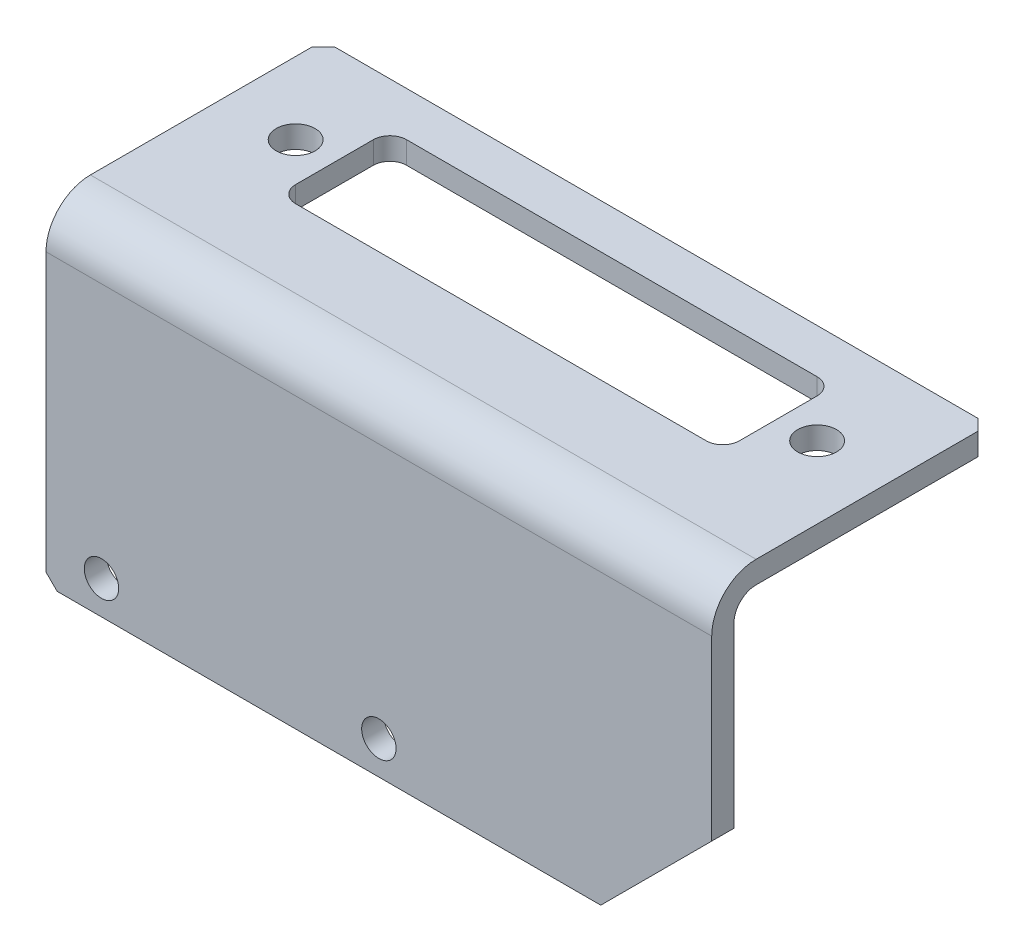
ISO-10303-21;
HEADER;
FILE_DESCRIPTION(('STEP AP214'),'2;1');
FILE_NAME('part.step','',(''),(''),'','','');
FILE_SCHEMA(('AUTOMOTIVE_DESIGN { 1 0 10303 214 1 1 1 1 }'));
ENDSEC;
DATA;
#1=APPLICATION_CONTEXT('core data for automotive mechanical design processes');
#2=APPLICATION_PROTOCOL_DEFINITION('international standard','automotive_design',2000,#1);
#3=PRODUCT_CONTEXT('',#1,'mechanical');
#4=PRODUCT('Part','Part','',(#3));
#5=PRODUCT_RELATED_PRODUCT_CATEGORY('part','',(#4));
#6=PRODUCT_DEFINITION_FORMATION('','',#4);
#7=PRODUCT_DEFINITION_CONTEXT('part definition',#1,'design');
#8=PRODUCT_DEFINITION('design','',#6,#7);
#9=PRODUCT_DEFINITION_SHAPE('','',#8);
#10=(LENGTH_UNIT() NAMED_UNIT(*) SI_UNIT(.MILLI.,.METRE.));
#11=(NAMED_UNIT(*) PLANE_ANGLE_UNIT() SI_UNIT($,.RADIAN.));
#12=(NAMED_UNIT(*) SI_UNIT($,.STERADIAN.) SOLID_ANGLE_UNIT());
#13=UNCERTAINTY_MEASURE_WITH_UNIT(LENGTH_MEASURE(1.E-05),#10,'distance_accuracy_value','');
#14=(GEOMETRIC_REPRESENTATION_CONTEXT(3) GLOBAL_UNCERTAINTY_ASSIGNED_CONTEXT((#13)) GLOBAL_UNIT_ASSIGNED_CONTEXT((#10,
#11,#12)) REPRESENTATION_CONTEXT('',''));
#15=CARTESIAN_POINT('',(0.,0.,0.));
#16=DIRECTION('',(0.,0.,1.));
#17=DIRECTION('',(1.,0.,0.));
#18=AXIS2_PLACEMENT_3D('',#15,#16,#17);
#19=CARTESIAN_POINT('',(53.5,-2.,-16.));
#20=DIRECTION('',(0.,-1.,0.));
#21=DIRECTION('',(0.,0.,-1.));
#22=AXIS2_PLACEMENT_3D('',#19,#20,#21);
#23=CYLINDRICAL_SURFACE('',#22,1.75);
#24=CARTESIAN_POINT('',(53.5,-2.,-16.));
#25=DIRECTION('',(0.,-1.,0.));
#26=DIRECTION('',(0.,0.,-1.));
#27=AXIS2_PLACEMENT_3D('',#24,#25,#26);
#28=CIRCLE('',#27,1.75);
#29=CARTESIAN_POINT('',(53.5,-2.,-17.75));
#30=VERTEX_POINT('',#29);
#31=EDGE_CURVE('E252',#30,#30,#28,.F.);
#32=ORIENTED_EDGE('',*,*,#31,.F.);
#33=EDGE_LOOP('',(#32));
#34=FACE_BOUND('',#33,.T.);
#35=CARTESIAN_POINT('',(53.5,0.,-16.));
#36=DIRECTION('',(0.,-1.,0.));
#37=DIRECTION('',(0.,0.,-1.));
#38=AXIS2_PLACEMENT_3D('',#35,#36,#37);
#39=CIRCLE('',#38,1.75);
#40=CARTESIAN_POINT('',(53.5,0.,-17.75));
#41=VERTEX_POINT('',#40);
#42=EDGE_CURVE('E19',#41,#41,#39,.T.);
#43=ORIENTED_EDGE('',*,*,#42,.F.);
#44=EDGE_LOOP('',(#43));
#45=FACE_BOUND('',#44,.T.);
#46=ADVANCED_FACE('F16',(#34,#45),#23,.F.);
#47=CARTESIAN_POINT('',(6.5,-2.,-16.));
#48=DIRECTION('',(0.,-1.,0.));
#49=DIRECTION('',(0.,0.,-1.));
#50=AXIS2_PLACEMENT_3D('',#47,#48,#49);
#51=CYLINDRICAL_SURFACE('',#50,1.75);
#52=CARTESIAN_POINT('',(6.5,-2.,-16.));
#53=DIRECTION('',(0.,-1.,0.));
#54=DIRECTION('',(0.,0.,-1.));
#55=AXIS2_PLACEMENT_3D('',#52,#53,#54);
#56=CIRCLE('',#55,1.75);
#57=CARTESIAN_POINT('',(6.5,-2.,-17.75));
#58=VERTEX_POINT('',#57);
#59=EDGE_CURVE('E249',#58,#58,#56,.F.);
#60=ORIENTED_EDGE('',*,*,#59,.F.);
#61=EDGE_LOOP('',(#60));
#62=FACE_BOUND('',#61,.T.);
#63=CARTESIAN_POINT('',(6.5,0.,-16.));
#64=DIRECTION('',(0.,-1.,0.));
#65=DIRECTION('',(0.,0.,-1.));
#66=AXIS2_PLACEMENT_3D('',#63,#64,#65);
#67=CIRCLE('',#66,1.75);
#68=CARTESIAN_POINT('',(6.5,0.,-17.75));
#69=VERTEX_POINT('',#68);
#70=EDGE_CURVE('E160',#69,#69,#67,.T.);
#71=ORIENTED_EDGE('',*,*,#70,.F.);
#72=EDGE_LOOP('',(#71));
#73=FACE_BOUND('',#72,.T.);
#74=ADVANCED_FACE('F428',(#62,#73),#51,.F.);
#75=CARTESIAN_POINT('',(11.5,-2.,-21.));
#76=DIRECTION('',(0.,0.,-1.));
#77=DIRECTION('',(-1.,0.,0.));
#78=AXIS2_PLACEMENT_3D('',#75,#76,#77);
#79=PLANE('',#78);
#80=DIRECTION('',(1.,0.,0.));
#81=VECTOR('',#80,1.);
#82=CARTESIAN_POINT('',(0.,-2.,-21.));
#83=LINE('',#82,#81);
#84=CARTESIAN_POINT('',(48.5,-2.,-21.));
#85=VERTEX_POINT('',#84);
#86=CARTESIAN_POINT('',(11.5,-2.,-21.));
#87=VERTEX_POINT('',#86);
#88=EDGE_CURVE('E248',#85,#87,#83,.F.);
#89=ORIENTED_EDGE('',*,*,#88,.F.);
#90=DIRECTION('',(0.,-1.,0.));
#91=VECTOR('',#90,1.);
#92=CARTESIAN_POINT('',(48.5,-2.,-21.));
#93=LINE('',#92,#91);
#94=CARTESIAN_POINT('',(48.5,0.,-21.));
#95=VERTEX_POINT('',#94);
#96=EDGE_CURVE('E187',#85,#95,#93,.F.);
#97=ORIENTED_EDGE('',*,*,#96,.T.);
#98=DIRECTION('',(1.,0.,0.));
#99=VECTOR('',#98,1.);
#100=CARTESIAN_POINT('',(0.,0.,-21.));
#101=LINE('',#100,#99);
#102=CARTESIAN_POINT('',(11.5,0.,-21.));
#103=VERTEX_POINT('',#102);
#104=EDGE_CURVE('E258',#103,#95,#101,.T.);
#105=ORIENTED_EDGE('',*,*,#104,.F.);
#106=DIRECTION('',(0.,-1.,0.));
#107=VECTOR('',#106,1.);
#108=CARTESIAN_POINT('',(11.5,-2.,-21.));
#109=LINE('',#108,#107);
#110=EDGE_CURVE('E195',#103,#87,#109,.T.);
#111=ORIENTED_EDGE('',*,*,#110,.T.);
#112=EDGE_LOOP('',(#89,#97,#105,#111));
#113=FACE_BOUND('',#112,.T.);
#114=ADVANCED_FACE('F417',(#113),#79,.F.);
#115=CARTESIAN_POINT('',(11.5,-2.,-19.5));
#116=DIRECTION('',(0.,-1.,0.));
#117=DIRECTION('',(0.,0.,-1.));
#118=AXIS2_PLACEMENT_3D('',#115,#116,#117);
#119=CYLINDRICAL_SURFACE('',#118,1.5);
#120=CARTESIAN_POINT('',(11.5,-2.,-19.5));
#121=DIRECTION('',(0.,-1.,0.));
#122=DIRECTION('',(0.,0.,-1.));
#123=AXIS2_PLACEMENT_3D('',#120,#121,#122);
#124=CIRCLE('',#123,1.5);
#125=CARTESIAN_POINT('',(10.,-2.,-19.5));
#126=VERTEX_POINT('',#125);
#127=EDGE_CURVE('E245',#87,#126,#124,.F.);
#128=ORIENTED_EDGE('',*,*,#127,.F.);
#129=ORIENTED_EDGE('',*,*,#110,.F.);
#130=CARTESIAN_POINT('',(11.5,0.,-19.5));
#131=DIRECTION('',(0.,-1.,0.));
#132=DIRECTION('',(0.,0.,-1.));
#133=AXIS2_PLACEMENT_3D('',#130,#131,#132);
#134=CIRCLE('',#133,1.5);
#135=CARTESIAN_POINT('',(10.,0.,-19.5));
#136=VERTEX_POINT('',#135);
#137=EDGE_CURVE('E259',#136,#103,#134,.T.);
#138=ORIENTED_EDGE('',*,*,#137,.F.);
#139=DIRECTION('',(0.,1.,0.));
#140=VECTOR('',#139,1.);
#141=CARTESIAN_POINT('',(10.,-2.,-19.5));
#142=LINE('',#141,#140);
#143=EDGE_CURVE('E193',#136,#126,#142,.F.);
#144=ORIENTED_EDGE('',*,*,#143,.T.);
#145=EDGE_LOOP('',(#128,#129,#138,#144));
#146=FACE_BOUND('',#145,.T.);
#147=ADVANCED_FACE('F419',(#146),#119,.F.);
#148=CARTESIAN_POINT('',(10.,-2.,-12.5));
#149=DIRECTION('',(-1.,0.,0.));
#150=DIRECTION('',(0.,0.,1.));
#151=AXIS2_PLACEMENT_3D('',#148,#149,#150);
#152=PLANE('',#151);
#153=DIRECTION('',(0.,0.,-1.));
#154=VECTOR('',#153,1.);
#155=CARTESIAN_POINT('',(10.,-2.,-4.));
#156=LINE('',#155,#154);
#157=CARTESIAN_POINT('',(10.,-2.,-12.5));
#158=VERTEX_POINT('',#157);
#159=EDGE_CURVE('E244',#126,#158,#156,.F.);
#160=ORIENTED_EDGE('',*,*,#159,.F.);
#161=ORIENTED_EDGE('',*,*,#143,.F.);
#162=DIRECTION('',(0.,0.,1.));
#163=VECTOR('',#162,1.);
#164=CARTESIAN_POINT('',(10.,0.,-25.));
#165=LINE('',#164,#163);
#166=CARTESIAN_POINT('',(10.,0.,-12.5));
#167=VERTEX_POINT('',#166);
#168=EDGE_CURVE('E261',#167,#136,#165,.F.);
#169=ORIENTED_EDGE('',*,*,#168,.F.);
#170=DIRECTION('',(0.,-1.,0.));
#171=VECTOR('',#170,1.);
#172=CARTESIAN_POINT('',(10.,-2.,-12.5));
#173=LINE('',#172,#171);
#174=EDGE_CURVE('E191',#167,#158,#173,.T.);
#175=ORIENTED_EDGE('',*,*,#174,.T.);
#176=EDGE_LOOP('',(#160,#161,#169,#175));
#177=FACE_BOUND('',#176,.T.);
#178=ADVANCED_FACE('F405',(#177),#152,.F.);
#179=CARTESIAN_POINT('',(11.5,-2.,-12.5));
#180=DIRECTION('',(0.,-1.,0.));
#181=DIRECTION('',(0.,0.,-1.));
#182=AXIS2_PLACEMENT_3D('',#179,#180,#181);
#183=CYLINDRICAL_SURFACE('',#182,1.5);
#184=CARTESIAN_POINT('',(11.5,-2.,-12.5));
#185=DIRECTION('',(0.,-1.,0.));
#186=DIRECTION('',(0.,0.,-1.));
#187=AXIS2_PLACEMENT_3D('',#184,#185,#186);
#188=CIRCLE('',#187,1.5);
#189=CARTESIAN_POINT('',(11.5,-2.,-11.));
#190=VERTEX_POINT('',#189);
#191=EDGE_CURVE('E241',#158,#190,#188,.F.);
#192=ORIENTED_EDGE('',*,*,#191,.F.);
#193=ORIENTED_EDGE('',*,*,#174,.F.);
#194=CARTESIAN_POINT('',(11.5,0.,-12.5));
#195=DIRECTION('',(0.,-1.,0.));
#196=DIRECTION('',(0.,0.,-1.));
#197=AXIS2_PLACEMENT_3D('',#194,#195,#196);
#198=CIRCLE('',#197,1.5);
#199=CARTESIAN_POINT('',(11.5,0.,-11.));
#200=VERTEX_POINT('',#199);
#201=EDGE_CURVE('E152',#200,#167,#198,.T.);
#202=ORIENTED_EDGE('',*,*,#201,.F.);
#203=DIRECTION('',(0.,1.,0.));
#204=VECTOR('',#203,1.);
#205=CARTESIAN_POINT('',(11.5,-2.,-11.));
#206=LINE('',#205,#204);
#207=EDGE_CURVE('E144',#200,#190,#206,.F.);
#208=ORIENTED_EDGE('',*,*,#207,.T.);
#209=EDGE_LOOP('',(#192,#193,#202,#208));
#210=FACE_BOUND('',#209,.T.);
#211=ADVANCED_FACE('F407',(#210),#183,.F.);
#212=CARTESIAN_POINT('',(48.5,-2.,-11.));
#213=DIRECTION('',(0.,0.,1.));
#214=DIRECTION('',(1.,0.,0.));
#215=AXIS2_PLACEMENT_3D('',#212,#213,#214);
#216=PLANE('',#215);
#217=DIRECTION('',(1.,0.,0.));
#218=VECTOR('',#217,1.);
#219=CARTESIAN_POINT('',(0.,-2.,-11.));
#220=LINE('',#219,#218);
#221=CARTESIAN_POINT('',(48.5,-2.,-11.));
#222=VERTEX_POINT('',#221);
#223=EDGE_CURVE('E240',#190,#222,#220,.T.);
#224=ORIENTED_EDGE('',*,*,#223,.F.);
#225=ORIENTED_EDGE('',*,*,#207,.F.);
#226=DIRECTION('',(1.,0.,0.));
#227=VECTOR('',#226,1.);
#228=CARTESIAN_POINT('',(0.,0.,-11.));
#229=LINE('',#228,#227);
#230=CARTESIAN_POINT('',(48.5,0.,-11.));
#231=VERTEX_POINT('',#230);
#232=EDGE_CURVE('E147',#231,#200,#229,.F.);
#233=ORIENTED_EDGE('',*,*,#232,.F.);
#234=DIRECTION('',(0.,-1.,0.));
#235=VECTOR('',#234,1.);
#236=CARTESIAN_POINT('',(48.5,-2.,-11.));
#237=LINE('',#236,#235);
#238=EDGE_CURVE('E133',#231,#222,#237,.T.);
#239=ORIENTED_EDGE('',*,*,#238,.T.);
#240=EDGE_LOOP('',(#224,#225,#233,#239));
#241=FACE_BOUND('',#240,.T.);
#242=ADVANCED_FACE('F148',(#241),#216,.F.);
#243=CARTESIAN_POINT('',(48.5,-2.,-12.5));
#244=DIRECTION('',(0.,-1.,0.));
#245=DIRECTION('',(0.,0.,-1.));
#246=AXIS2_PLACEMENT_3D('',#243,#244,#245);
#247=CYLINDRICAL_SURFACE('',#246,1.5);
#248=CARTESIAN_POINT('',(48.5,-2.,-12.5));
#249=DIRECTION('',(0.,-1.,0.));
#250=DIRECTION('',(0.,0.,-1.));
#251=AXIS2_PLACEMENT_3D('',#248,#249,#250);
#252=CIRCLE('',#251,1.5);
#253=CARTESIAN_POINT('',(50.,-2.,-12.5));
#254=VERTEX_POINT('',#253);
#255=EDGE_CURVE('E140',#222,#254,#252,.F.);
#256=ORIENTED_EDGE('',*,*,#255,.F.);
#257=ORIENTED_EDGE('',*,*,#238,.F.);
#258=CARTESIAN_POINT('',(48.5,0.,-12.5));
#259=DIRECTION('',(0.,-1.,0.));
#260=DIRECTION('',(0.,0.,-1.));
#261=AXIS2_PLACEMENT_3D('',#258,#259,#260);
#262=CIRCLE('',#261,1.5);
#263=CARTESIAN_POINT('',(50.,0.,-12.5));
#264=VERTEX_POINT('',#263);
#265=EDGE_CURVE('E137',#264,#231,#262,.T.);
#266=ORIENTED_EDGE('',*,*,#265,.F.);
#267=DIRECTION('',(0.,1.,0.));
#268=VECTOR('',#267,1.);
#269=CARTESIAN_POINT('',(50.,-2.,-12.5));
#270=LINE('',#269,#268);
#271=EDGE_CURVE('E128',#264,#254,#270,.F.);
#272=ORIENTED_EDGE('',*,*,#271,.T.);
#273=EDGE_LOOP('',(#256,#257,#266,#272));
#274=FACE_BOUND('',#273,.T.);
#275=ADVANCED_FACE('F135',(#274),#247,.F.);
#276=CARTESIAN_POINT('',(50.,-2.,-19.5));
#277=DIRECTION('',(1.,0.,0.));
#278=DIRECTION('',(0.,0.,-1.));
#279=AXIS2_PLACEMENT_3D('',#276,#277,#278);
#280=PLANE('',#279);
#281=DIRECTION('',(0.,0.,-1.));
#282=VECTOR('',#281,1.);
#283=CARTESIAN_POINT('',(50.,-2.,-4.));
#284=LINE('',#283,#282);
#285=CARTESIAN_POINT('',(50.,-2.,-19.5));
#286=VERTEX_POINT('',#285);
#287=EDGE_CURVE('E238',#254,#286,#284,.T.);
#288=ORIENTED_EDGE('',*,*,#287,.F.);
#289=ORIENTED_EDGE('',*,*,#271,.F.);
#290=DIRECTION('',(0.,0.,1.));
#291=VECTOR('',#290,1.);
#292=CARTESIAN_POINT('',(50.,0.,-25.));
#293=LINE('',#292,#291);
#294=CARTESIAN_POINT('',(50.,0.,-19.5));
#295=VERTEX_POINT('',#294);
#296=EDGE_CURVE('E158',#295,#264,#293,.T.);
#297=ORIENTED_EDGE('',*,*,#296,.F.);
#298=DIRECTION('',(0.,-1.,0.));
#299=VECTOR('',#298,1.);
#300=CARTESIAN_POINT('',(50.,-2.,-19.5));
#301=LINE('',#300,#299);
#302=EDGE_CURVE('E185',#295,#286,#301,.T.);
#303=ORIENTED_EDGE('',*,*,#302,.T.);
#304=EDGE_LOOP('',(#288,#289,#297,#303));
#305=FACE_BOUND('',#304,.T.);
#306=ADVANCED_FACE('F409',(#305),#280,.F.);
#307=CARTESIAN_POINT('',(48.5,-2.,-19.5));
#308=DIRECTION('',(0.,-1.,0.));
#309=DIRECTION('',(0.,0.,-1.));
#310=AXIS2_PLACEMENT_3D('',#307,#308,#309);
#311=CYLINDRICAL_SURFACE('',#310,1.5);
#312=CARTESIAN_POINT('',(48.5,-2.,-19.5));
#313=DIRECTION('',(0.,-1.,0.));
#314=DIRECTION('',(0.,0.,-1.));
#315=AXIS2_PLACEMENT_3D('',#312,#313,#314);
#316=CIRCLE('',#315,1.5);
#317=EDGE_CURVE('E234',#286,#85,#316,.F.);
#318=ORIENTED_EDGE('',*,*,#317,.F.);
#319=ORIENTED_EDGE('',*,*,#302,.F.);
#320=CARTESIAN_POINT('',(48.5,0.,-19.5));
#321=DIRECTION('',(0.,-1.,0.));
#322=DIRECTION('',(0.,0.,-1.));
#323=AXIS2_PLACEMENT_3D('',#320,#321,#322);
#324=CIRCLE('',#323,1.5);
#325=EDGE_CURVE('E256',#95,#295,#324,.T.);
#326=ORIENTED_EDGE('',*,*,#325,.F.);
#327=ORIENTED_EDGE('',*,*,#96,.F.);
#328=EDGE_LOOP('',(#318,#319,#326,#327));
#329=FACE_BOUND('',#328,.T.);
#330=ADVANCED_FACE('F414',(#329),#311,.F.);
#331=CARTESIAN_POINT('',(0.,-2.,-25.));
#332=DIRECTION('',(0.,0.,-1.));
#333=DIRECTION('',(-1.,0.,0.));
#334=AXIS2_PLACEMENT_3D('',#331,#332,#333);
#335=PLANE('',#334);
#336=DIRECTION('',(1.,0.,0.));
#337=VECTOR('',#336,1.);
#338=CARTESIAN_POINT('',(0.,-2.,-25.));
#339=LINE('',#338,#337);
#340=CARTESIAN_POINT('',(1.,-2.,-25.));
#341=VERTEX_POINT('',#340);
#342=CARTESIAN_POINT('',(59.,-2.,-25.));
#343=VERTEX_POINT('',#342);
#344=EDGE_CURVE('E291',#341,#343,#339,.T.);
#345=ORIENTED_EDGE('',*,*,#344,.F.);
#346=DIRECTION('',(0.,1.,0.));
#347=VECTOR('',#346,1.);
#348=CARTESIAN_POINT('',(1.,-2.,-25.));
#349=LINE('',#348,#347);
#350=CARTESIAN_POINT('',(1.,0.,-25.));
#351=VERTEX_POINT('',#350);
#352=EDGE_CURVE('E271',#351,#341,#349,.F.);
#353=ORIENTED_EDGE('',*,*,#352,.F.);
#354=DIRECTION('',(1.,0.,0.));
#355=VECTOR('',#354,1.);
#356=CARTESIAN_POINT('',(0.,0.,-25.));
#357=LINE('',#356,#355);
#358=CARTESIAN_POINT('',(59.,0.,-25.));
#359=VERTEX_POINT('',#358);
#360=EDGE_CURVE('E167',#359,#351,#357,.F.);
#361=ORIENTED_EDGE('',*,*,#360,.F.);
#362=DIRECTION('',(0.,1.,0.));
#363=VECTOR('',#362,1.);
#364=CARTESIAN_POINT('',(59.,-2.,-25.));
#365=LINE('',#364,#363);
#366=EDGE_CURVE('E177',#359,#343,#365,.F.);
#367=ORIENTED_EDGE('',*,*,#366,.T.);
#368=EDGE_LOOP('',(#345,#353,#361,#367));
#369=FACE_BOUND('',#368,.T.);
#370=ADVANCED_FACE('F484',(#369),#335,.T.);
#371=CARTESIAN_POINT('',(60.,-2.,-24.));
#372=DIRECTION('',(-0.707106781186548,0.,0.707106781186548));
#373=DIRECTION('',(0.707106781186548,0.,0.707106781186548));
#374=AXIS2_PLACEMENT_3D('',#371,#372,#373);
#375=PLANE('',#374);
#376=ORIENTED_EDGE('',*,*,#366,.F.);
#377=DIRECTION('',(-0.707106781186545,0.,-0.70710678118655));
#378=VECTOR('',#377,1.);
#379=CARTESIAN_POINT('',(60.,0.,-24.));
#380=LINE('',#379,#378);
#381=CARTESIAN_POINT('',(60.,0.,-24.));
#382=VERTEX_POINT('',#381);
#383=EDGE_CURVE('E170',#382,#359,#380,.T.);
#384=ORIENTED_EDGE('',*,*,#383,.F.);
#385=DIRECTION('',(0.,1.,0.));
#386=VECTOR('',#385,1.);
#387=CARTESIAN_POINT('',(60.,0.,-24.));
#388=LINE('',#387,#386);
#389=CARTESIAN_POINT('',(60.,-2.,-24.));
#390=VERTEX_POINT('',#389);
#391=EDGE_CURVE('E283',#390,#382,#388,.T.);
#392=ORIENTED_EDGE('',*,*,#391,.F.);
#393=DIRECTION('',(0.707106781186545,0.,0.70710678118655));
#394=VECTOR('',#393,1.);
#395=CARTESIAN_POINT('',(59.,-2.,-25.));
#396=LINE('',#395,#394);
#397=EDGE_CURVE('E255',#343,#390,#396,.T.);
#398=ORIENTED_EDGE('',*,*,#397,.F.);
#399=EDGE_LOOP('',(#376,#384,#392,#398));
#400=FACE_BOUND('',#399,.T.);
#401=ADVANCED_FACE('F481',(#400),#375,.F.);
#402=CARTESIAN_POINT('',(0.,0.,-25.));
#403=DIRECTION('',(0.,1.,0.));
#404=DIRECTION('',(0.,0.,1.));
#405=AXIS2_PLACEMENT_3D('',#402,#403,#404);
#406=PLANE('',#405);
#407=ORIENTED_EDGE('',*,*,#104,.T.);
#408=ORIENTED_EDGE('',*,*,#325,.T.);
#409=ORIENTED_EDGE('',*,*,#296,.T.);
#410=ORIENTED_EDGE('',*,*,#265,.T.);
#411=ORIENTED_EDGE('',*,*,#232,.T.);
#412=ORIENTED_EDGE('',*,*,#201,.T.);
#413=ORIENTED_EDGE('',*,*,#168,.T.);
#414=ORIENTED_EDGE('',*,*,#137,.T.);
#415=EDGE_LOOP('',(#407,#408,#409,#410,#411,#412,#413,#414));
#416=FACE_BOUND('',#415,.T.);
#417=ORIENTED_EDGE('',*,*,#70,.T.);
#418=EDGE_LOOP('',(#417));
#419=FACE_BOUND('',#418,.T.);
#420=ORIENTED_EDGE('',*,*,#42,.T.);
#421=EDGE_LOOP('',(#420));
#422=FACE_BOUND('',#421,.T.);
#423=DIRECTION('',(-0.707106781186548,0.,0.707106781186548));
#424=VECTOR('',#423,1.);
#425=CARTESIAN_POINT('',(0.,0.,-24.));
#426=LINE('',#425,#424);
#427=CARTESIAN_POINT('',(0.,0.,-24.));
#428=VERTEX_POINT('',#427);
#429=EDGE_CURVE('E237',#428,#351,#426,.F.);
#430=ORIENTED_EDGE('',*,*,#429,.F.);
#431=DIRECTION('',(0.,0.,-1.));
#432=VECTOR('',#431,1.);
#433=CARTESIAN_POINT('',(0.,0.,0.));
#434=LINE('',#433,#432);
#435=CARTESIAN_POINT('',(0.,0.,-4.));
#436=VERTEX_POINT('',#435);
#437=EDGE_CURVE('E224',#428,#436,#434,.F.);
#438=ORIENTED_EDGE('',*,*,#437,.T.);
#439=DIRECTION('',(1.,0.,0.));
#440=VECTOR('',#439,1.);
#441=CARTESIAN_POINT('',(0.,0.,-4.));
#442=LINE('',#441,#440);
#443=CARTESIAN_POINT('',(60.,0.,-4.));
#444=VERTEX_POINT('',#443);
#445=EDGE_CURVE('E257',#444,#436,#442,.F.);
#446=ORIENTED_EDGE('',*,*,#445,.F.);
#447=DIRECTION('',(0.,0.,-1.));
#448=VECTOR('',#447,1.);
#449=CARTESIAN_POINT('',(60.,0.,0.));
#450=LINE('',#449,#448);
#451=EDGE_CURVE('E286',#382,#444,#450,.F.);
#452=ORIENTED_EDGE('',*,*,#451,.F.);
#453=ORIENTED_EDGE('',*,*,#383,.T.);
#454=ORIENTED_EDGE('',*,*,#360,.T.);
#455=EDGE_LOOP('',(#430,#438,#446,#452,#453,#454));
#456=FACE_BOUND('',#455,.T.);
#457=ADVANCED_FACE('F155',(#416,#419,#422,#456),#406,.T.);
#458=CARTESIAN_POINT('',(0.,-4.,-4.));
#459=DIRECTION('',(1.,0.,0.));
#460=DIRECTION('',(0.,0.,-1.));
#461=AXIS2_PLACEMENT_3D('',#458,#459,#460);
#462=CYLINDRICAL_SURFACE('',#461,4.);
#463=ORIENTED_EDGE('',*,*,#445,.T.);
#464=CARTESIAN_POINT('',(0.,-4.,-4.));
#465=DIRECTION('',(1.,0.,0.));
#466=DIRECTION('',(0.,0.,-1.));
#467=AXIS2_PLACEMENT_3D('',#464,#465,#466);
#468=CIRCLE('',#467,4.);
#469=CARTESIAN_POINT('',(0.,-4.,0.));
#470=VERTEX_POINT('',#469);
#471=EDGE_CURVE('E221',#436,#470,#468,.T.);
#472=ORIENTED_EDGE('',*,*,#471,.T.);
#473=DIRECTION('',(1.,0.,0.));
#474=VECTOR('',#473,1.);
#475=CARTESIAN_POINT('',(0.,-4.,0.));
#476=LINE('',#475,#474);
#477=CARTESIAN_POINT('',(60.,-4.,0.));
#478=VERTEX_POINT('',#477);
#479=EDGE_CURVE('E317',#478,#470,#476,.F.);
#480=ORIENTED_EDGE('',*,*,#479,.F.);
#481=CARTESIAN_POINT('',(60.,-4.,-4.));
#482=DIRECTION('',(1.,0.,0.));
#483=DIRECTION('',(0.,0.,-1.));
#484=AXIS2_PLACEMENT_3D('',#481,#482,#483);
#485=CIRCLE('',#484,4.);
#486=EDGE_CURVE('E230',#444,#478,#485,.T.);
#487=ORIENTED_EDGE('',*,*,#486,.F.);
#488=EDGE_LOOP('',(#463,#472,#480,#487));
#489=FACE_BOUND('',#488,.T.);
#490=ADVANCED_FACE('F338',(#489),#462,.T.);
#491=CARTESIAN_POINT('',(0.,-29.,0.));
#492=DIRECTION('',(-0.707106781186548,-0.707106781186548,0.));
#493=DIRECTION('',(0.707106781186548,-0.707106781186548,0.));
#494=AXIS2_PLACEMENT_3D('',#491,#492,#493);
#495=PLANE('',#494);
#496=DIRECTION('',(0.707106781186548,-0.707106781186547,0.));
#497=VECTOR('',#496,1.);
#498=CARTESIAN_POINT('',(0.,-29.,0.));
#499=LINE('',#498,#497);
#500=CARTESIAN_POINT('',(0.,-29.,0.));
#501=VERTEX_POINT('',#500);
#502=CARTESIAN_POINT('',(1.,-30.,0.));
#503=VERTEX_POINT('',#502);
#504=EDGE_CURVE('E311',#501,#503,#499,.T.);
#505=ORIENTED_EDGE('',*,*,#504,.F.);
#506=DIRECTION('',(0.,0.,-1.));
#507=VECTOR('',#506,1.);
#508=CARTESIAN_POINT('',(0.,-29.,0.));
#509=LINE('',#508,#507);
#510=CARTESIAN_POINT('',(0.,-29.,-2.));
#511=VERTEX_POINT('',#510);
#512=EDGE_CURVE('E220',#501,#511,#509,.T.);
#513=ORIENTED_EDGE('',*,*,#512,.T.);
#514=DIRECTION('',(0.707106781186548,-0.707106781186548,0.));
#515=VECTOR('',#514,1.);
#516=CARTESIAN_POINT('',(0.,-29.,-2.));
#517=LINE('',#516,#515);
#518=CARTESIAN_POINT('',(0.999999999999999,-30.,-2.));
#519=VERTEX_POINT('',#518);
#520=EDGE_CURVE('E34',#511,#519,#517,.T.);
#521=ORIENTED_EDGE('',*,*,#520,.T.);
#522=DIRECTION('',(0.,0.,-1.));
#523=VECTOR('',#522,1.);
#524=CARTESIAN_POINT('',(1.,-30.,0.));
#525=LINE('',#524,#523);
#526=EDGE_CURVE('E294',#503,#519,#525,.T.);
#527=ORIENTED_EDGE('',*,*,#526,.F.);
#528=EDGE_LOOP('',(#505,#513,#521,#527));
#529=FACE_BOUND('',#528,.T.);
#530=ADVANCED_FACE('F473',(#529),#495,.T.);
#531=CARTESIAN_POINT('',(0.,-2.,-4.));
#532=DIRECTION('',(0.,-1.,0.));
#533=DIRECTION('',(0.,0.,-1.));
#534=AXIS2_PLACEMENT_3D('',#531,#532,#533);
#535=PLANE('',#534);
#536=ORIENTED_EDGE('',*,*,#287,.T.);
#537=ORIENTED_EDGE('',*,*,#317,.T.);
#538=ORIENTED_EDGE('',*,*,#88,.T.);
#539=ORIENTED_EDGE('',*,*,#127,.T.);
#540=ORIENTED_EDGE('',*,*,#159,.T.);
#541=ORIENTED_EDGE('',*,*,#191,.T.);
#542=ORIENTED_EDGE('',*,*,#223,.T.);
#543=ORIENTED_EDGE('',*,*,#255,.T.);
#544=EDGE_LOOP('',(#536,#537,#538,#539,#540,#541,#542,#543));
#545=FACE_BOUND('',#544,.T.);
#546=ORIENTED_EDGE('',*,*,#59,.T.);
#547=EDGE_LOOP('',(#546));
#548=FACE_BOUND('',#547,.T.);
#549=ORIENTED_EDGE('',*,*,#31,.T.);
#550=EDGE_LOOP('',(#549));
#551=FACE_BOUND('',#550,.T.);
#552=DIRECTION('',(1.,0.,0.));
#553=VECTOR('',#552,1.);
#554=CARTESIAN_POINT('',(0.,-2.,-4.));
#555=LINE('',#554,#553);
#556=CARTESIAN_POINT('',(60.,-2.,-4.));
#557=VERTEX_POINT('',#556);
#558=CARTESIAN_POINT('',(0.,-2.,-4.));
#559=VERTEX_POINT('',#558);
#560=EDGE_CURVE('E233',#557,#559,#555,.F.);
#561=ORIENTED_EDGE('',*,*,#560,.T.);
#562=DIRECTION('',(0.,0.,-1.));
#563=VECTOR('',#562,1.);
#564=CARTESIAN_POINT('',(0.,-2.,0.));
#565=LINE('',#564,#563);
#566=CARTESIAN_POINT('',(0.,-2.,-24.));
#567=VERTEX_POINT('',#566);
#568=EDGE_CURVE('E219',#559,#567,#565,.T.);
#569=ORIENTED_EDGE('',*,*,#568,.T.);
#570=DIRECTION('',(-0.707106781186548,0.,0.707106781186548));
#571=VECTOR('',#570,1.);
#572=CARTESIAN_POINT('',(0.,-2.,-24.));
#573=LINE('',#572,#571);
#574=EDGE_CURVE('E308',#341,#567,#573,.T.);
#575=ORIENTED_EDGE('',*,*,#574,.F.);
#576=ORIENTED_EDGE('',*,*,#344,.T.);
#577=ORIENTED_EDGE('',*,*,#397,.T.);
#578=DIRECTION('',(0.,0.,-1.));
#579=VECTOR('',#578,1.);
#580=CARTESIAN_POINT('',(60.,-2.,0.));
#581=LINE('',#580,#579);
#582=EDGE_CURVE('E228',#557,#390,#581,.T.);
#583=ORIENTED_EDGE('',*,*,#582,.F.);
#584=EDGE_LOOP('',(#561,#569,#575,#576,#577,#583));
#585=FACE_BOUND('',#584,.T.);
#586=ADVANCED_FACE('F399',(#545,#548,#551,#585),#535,.T.);
#587=CARTESIAN_POINT('',(0.,-2.,-24.));
#588=DIRECTION('',(-0.707106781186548,0.,-0.707106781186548));
#589=DIRECTION('',(-0.707106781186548,0.,0.707106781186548));
#590=AXIS2_PLACEMENT_3D('',#587,#588,#589);
#591=PLANE('',#590);
#592=ORIENTED_EDGE('',*,*,#574,.T.);
#593=DIRECTION('',(0.,1.,0.));
#594=VECTOR('',#593,1.);
#595=CARTESIAN_POINT('',(0.,0.,-24.));
#596=LINE('',#595,#594);
#597=EDGE_CURVE('E215',#567,#428,#596,.T.);
#598=ORIENTED_EDGE('',*,*,#597,.T.);
#599=ORIENTED_EDGE('',*,*,#429,.T.);
#600=ORIENTED_EDGE('',*,*,#352,.T.);
#601=EDGE_LOOP('',(#592,#598,#599,#600));
#602=FACE_BOUND('',#601,.T.);
#603=ADVANCED_FACE('F467',(#602),#591,.T.);
#604=CARTESIAN_POINT('',(0.,-4.,0.));
#605=DIRECTION('',(0.,0.,1.));
#606=DIRECTION('',(1.,0.,0.));
#607=AXIS2_PLACEMENT_3D('',#604,#605,#606);
#608=PLANE('',#607);
#609=CARTESIAN_POINT('',(30.,-27.,0.));
#610=DIRECTION('',(0.,0.,-1.));
#611=DIRECTION('',(-1.,0.,0.));
#612=AXIS2_PLACEMENT_3D('',#609,#610,#611);
#613=CIRCLE('',#612,1.55);
#614=CARTESIAN_POINT('',(28.45,-27.,0.));
#615=VERTEX_POINT('',#614);
#616=EDGE_CURVE('E208',#615,#615,#613,.T.);
#617=ORIENTED_EDGE('',*,*,#616,.T.);
#618=EDGE_LOOP('',(#617));
#619=FACE_BOUND('',#618,.T.);
#620=CARTESIAN_POINT('',(5.,-27.,0.));
#621=DIRECTION('',(0.,0.,-1.));
#622=DIRECTION('',(-1.,0.,0.));
#623=AXIS2_PLACEMENT_3D('',#620,#621,#622);
#624=CIRCLE('',#623,1.55);
#625=CARTESIAN_POINT('',(3.45,-27.,0.));
#626=VERTEX_POINT('',#625);
#627=EDGE_CURVE('E212',#626,#626,#624,.T.);
#628=ORIENTED_EDGE('',*,*,#627,.T.);
#629=EDGE_LOOP('',(#628));
#630=FACE_BOUND('',#629,.T.);
#631=ORIENTED_EDGE('',*,*,#479,.T.);
#632=DIRECTION('',(0.,1.,0.));
#633=VECTOR('',#632,1.);
#634=CARTESIAN_POINT('',(0.,0.,0.));
#635=LINE('',#634,#633);
#636=EDGE_CURVE('E223',#470,#501,#635,.F.);
#637=ORIENTED_EDGE('',*,*,#636,.T.);
#638=ORIENTED_EDGE('',*,*,#504,.T.);
#639=DIRECTION('',(1.,0.,0.));
#640=VECTOR('',#639,1.);
#641=CARTESIAN_POINT('',(0.,-30.,0.));
#642=LINE('',#641,#640);
#643=CARTESIAN_POINT('',(50.,-30.,0.));
#644=VERTEX_POINT('',#643);
#645=EDGE_CURVE('E297',#644,#503,#642,.F.);
#646=ORIENTED_EDGE('',*,*,#645,.F.);
#647=DIRECTION('',(-0.707106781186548,-0.707106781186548,0.));
#648=VECTOR('',#647,1.);
#649=CARTESIAN_POINT('',(60.,-20.,0.));
#650=LINE('',#649,#648);
#651=CARTESIAN_POINT('',(60.,-20.,0.));
#652=VERTEX_POINT('',#651);
#653=EDGE_CURVE('E274',#644,#652,#650,.F.);
#654=ORIENTED_EDGE('',*,*,#653,.T.);
#655=DIRECTION('',(0.,1.,0.));
#656=VECTOR('',#655,1.);
#657=CARTESIAN_POINT('',(60.,0.,0.));
#658=LINE('',#657,#656);
#659=EDGE_CURVE('E229',#478,#652,#658,.F.);
#660=ORIENTED_EDGE('',*,*,#659,.F.);
#661=EDGE_LOOP('',(#631,#637,#638,#646,#654,#660));
#662=FACE_BOUND('',#661,.T.);
#663=ADVANCED_FACE('F463',(#619,#630,#662),#608,.T.);
#664=CARTESIAN_POINT('',(0.,-4.,-4.));
#665=DIRECTION('',(1.,0.,0.));
#666=DIRECTION('',(0.,0.,-1.));
#667=AXIS2_PLACEMENT_3D('',#664,#665,#666);
#668=CYLINDRICAL_SURFACE('',#667,2.);
#669=CARTESIAN_POINT('',(60.,-4.,-4.));
#670=DIRECTION('',(1.,0.,0.));
#671=DIRECTION('',(0.,0.,-1.));
#672=AXIS2_PLACEMENT_3D('',#669,#670,#671);
#673=CIRCLE('',#672,2.);
#674=CARTESIAN_POINT('',(60.,-4.,-2.));
#675=VERTEX_POINT('',#674);
#676=EDGE_CURVE('E225',#675,#557,#673,.F.);
#677=ORIENTED_EDGE('',*,*,#676,.F.);
#678=DIRECTION('',(-1.,0.,0.));
#679=VECTOR('',#678,1.);
#680=CARTESIAN_POINT('',(0.,-4.,-2.));
#681=LINE('',#680,#679);
#682=CARTESIAN_POINT('',(0.,-4.,-2.));
#683=VERTEX_POINT('',#682);
#684=EDGE_CURVE('E211',#683,#675,#681,.F.);
#685=ORIENTED_EDGE('',*,*,#684,.F.);
#686=CARTESIAN_POINT('',(0.,-4.,-4.));
#687=DIRECTION('',(1.,0.,0.));
#688=DIRECTION('',(0.,0.,-1.));
#689=AXIS2_PLACEMENT_3D('',#686,#687,#688);
#690=CIRCLE('',#689,2.);
#691=EDGE_CURVE('E216',#683,#559,#690,.F.);
#692=ORIENTED_EDGE('',*,*,#691,.T.);
#693=ORIENTED_EDGE('',*,*,#560,.F.);
#694=EDGE_LOOP('',(#677,#685,#692,#693));
#695=FACE_BOUND('',#694,.T.);
#696=ADVANCED_FACE('F459',(#695),#668,.F.);
#697=CARTESIAN_POINT('',(60.,0.,0.));
#698=DIRECTION('',(1.,0.,0.));
#699=DIRECTION('',(0.,0.,-1.));
#700=AXIS2_PLACEMENT_3D('',#697,#698,#699);
#701=PLANE('',#700);
#702=ORIENTED_EDGE('',*,*,#391,.T.);
#703=ORIENTED_EDGE('',*,*,#451,.T.);
#704=ORIENTED_EDGE('',*,*,#486,.T.);
#705=ORIENTED_EDGE('',*,*,#659,.T.);
#706=DIRECTION('',(0.,0.,1.));
#707=VECTOR('',#706,1.);
#708=CARTESIAN_POINT('',(60.,-20.,0.));
#709=LINE('',#708,#707);
#710=CARTESIAN_POINT('',(60.,-20.,-2.));
#711=VERTEX_POINT('',#710);
#712=EDGE_CURVE('E278',#652,#711,#709,.F.);
#713=ORIENTED_EDGE('',*,*,#712,.T.);
#714=DIRECTION('',(0.,1.,0.));
#715=VECTOR('',#714,1.);
#716=CARTESIAN_POINT('',(60.,-30.,-2.));
#717=LINE('',#716,#715);
#718=EDGE_CURVE('E363',#675,#711,#717,.F.);
#719=ORIENTED_EDGE('',*,*,#718,.F.);
#720=ORIENTED_EDGE('',*,*,#676,.T.);
#721=ORIENTED_EDGE('',*,*,#582,.T.);
#722=EDGE_LOOP('',(#702,#703,#704,#705,#713,#719,#720,#721));
#723=FACE_BOUND('',#722,.T.);
#724=ADVANCED_FACE('F455',(#723),#701,.T.);
#725=CARTESIAN_POINT('',(60.,-20.,0.));
#726=DIRECTION('',(-0.707106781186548,0.707106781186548,0.));
#727=DIRECTION('',(-0.707106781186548,-0.707106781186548,0.));
#728=AXIS2_PLACEMENT_3D('',#725,#726,#727);
#729=PLANE('',#728);
#730=DIRECTION('',(0.,0.,-1.));
#731=VECTOR('',#730,1.);
#732=CARTESIAN_POINT('',(50.,-30.,0.));
#733=LINE('',#732,#731);
#734=CARTESIAN_POINT('',(50.,-30.,-2.));
#735=VERTEX_POINT('',#734);
#736=EDGE_CURVE('E277',#735,#644,#733,.F.);
#737=ORIENTED_EDGE('',*,*,#736,.F.);
#738=DIRECTION('',(-0.707106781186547,-0.707106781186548,0.));
#739=VECTOR('',#738,1.);
#740=CARTESIAN_POINT('',(60.,-20.,-2.));
#741=LINE('',#740,#739);
#742=EDGE_CURVE('E203',#711,#735,#741,.T.);
#743=ORIENTED_EDGE('',*,*,#742,.F.);
#744=ORIENTED_EDGE('',*,*,#712,.F.);
#745=ORIENTED_EDGE('',*,*,#653,.F.);
#746=EDGE_LOOP('',(#737,#743,#744,#745));
#747=FACE_BOUND('',#746,.T.);
#748=ADVANCED_FACE('F451',(#747),#729,.F.);
#749=CARTESIAN_POINT('',(0.,-30.,0.));
#750=DIRECTION('',(0.,-1.,0.));
#751=DIRECTION('',(0.,0.,-1.));
#752=AXIS2_PLACEMENT_3D('',#749,#750,#751);
#753=PLANE('',#752);
#754=ORIENTED_EDGE('',*,*,#645,.T.);
#755=ORIENTED_EDGE('',*,*,#526,.T.);
#756=DIRECTION('',(-1.,0.,0.));
#757=VECTOR('',#756,1.);
#758=CARTESIAN_POINT('',(0.,-30.,-2.));
#759=LINE('',#758,#757);
#760=EDGE_CURVE('E200',#735,#519,#759,.T.);
#761=ORIENTED_EDGE('',*,*,#760,.F.);
#762=ORIENTED_EDGE('',*,*,#736,.T.);
#763=EDGE_LOOP('',(#754,#755,#761,#762));
#764=FACE_BOUND('',#763,.T.);
#765=ADVANCED_FACE('F448',(#764),#753,.T.);
#766=CARTESIAN_POINT('',(0.,0.,0.));
#767=DIRECTION('',(1.,0.,0.));
#768=DIRECTION('',(0.,0.,-1.));
#769=AXIS2_PLACEMENT_3D('',#766,#767,#768);
#770=PLANE('',#769);
#771=ORIENTED_EDGE('',*,*,#568,.F.);
#772=ORIENTED_EDGE('',*,*,#691,.F.);
#773=DIRECTION('',(0.,1.,0.));
#774=VECTOR('',#773,1.);
#775=CARTESIAN_POINT('',(0.,-30.,-2.));
#776=LINE('',#775,#774);
#777=EDGE_CURVE('E202',#511,#683,#776,.T.);
#778=ORIENTED_EDGE('',*,*,#777,.F.);
#779=ORIENTED_EDGE('',*,*,#512,.F.);
#780=ORIENTED_EDGE('',*,*,#636,.F.);
#781=ORIENTED_EDGE('',*,*,#471,.F.);
#782=ORIENTED_EDGE('',*,*,#437,.F.);
#783=ORIENTED_EDGE('',*,*,#597,.F.);
#784=EDGE_LOOP('',(#771,#772,#778,#779,#780,#781,#782,#783));
#785=FACE_BOUND('',#784,.T.);
#786=ADVANCED_FACE('F345',(#785),#770,.F.);
#787=CARTESIAN_POINT('',(5.,-27.,-2.));
#788=DIRECTION('',(0.,0.,-1.));
#789=DIRECTION('',(-1.,0.,0.));
#790=AXIS2_PLACEMENT_3D('',#787,#788,#789);
#791=CYLINDRICAL_SURFACE('',#790,1.55);
#792=CARTESIAN_POINT('',(5.,-27.,-2.));
#793=DIRECTION('',(0.,0.,-1.));
#794=DIRECTION('',(-1.,0.,0.));
#795=AXIS2_PLACEMENT_3D('',#792,#793,#794);
#796=CIRCLE('',#795,1.55);
#797=CARTESIAN_POINT('',(3.45,-27.,-2.));
#798=VERTEX_POINT('',#797);
#799=EDGE_CURVE('E25',#798,#798,#796,.F.);
#800=ORIENTED_EDGE('',*,*,#799,.F.);
#801=EDGE_LOOP('',(#800));
#802=FACE_BOUND('',#801,.T.);
#803=ORIENTED_EDGE('',*,*,#627,.F.);
#804=EDGE_LOOP('',(#803));
#805=FACE_BOUND('',#804,.T.);
#806=ADVANCED_FACE('F438',(#802,#805),#791,.F.);
#807=CARTESIAN_POINT('',(30.,-27.,-2.));
#808=DIRECTION('',(0.,0.,-1.));
#809=DIRECTION('',(-1.,0.,0.));
#810=AXIS2_PLACEMENT_3D('',#807,#808,#809);
#811=CYLINDRICAL_SURFACE('',#810,1.55);
#812=CARTESIAN_POINT('',(30.,-27.,-2.));
#813=DIRECTION('',(0.,0.,-1.));
#814=DIRECTION('',(-1.,0.,0.));
#815=AXIS2_PLACEMENT_3D('',#812,#813,#814);
#816=CIRCLE('',#815,1.55);
#817=CARTESIAN_POINT('',(28.45,-27.,-2.));
#818=VERTEX_POINT('',#817);
#819=EDGE_CURVE('E11',#818,#818,#816,.F.);
#820=ORIENTED_EDGE('',*,*,#819,.F.);
#821=EDGE_LOOP('',(#820));
#822=FACE_BOUND('',#821,.T.);
#823=ORIENTED_EDGE('',*,*,#616,.F.);
#824=EDGE_LOOP('',(#823));
#825=FACE_BOUND('',#824,.T.);
#826=ADVANCED_FACE('F432',(#822,#825),#811,.F.);
#827=CARTESIAN_POINT('',(0.,-30.,-2.));
#828=DIRECTION('',(0.,0.,-1.));
#829=DIRECTION('',(-1.,0.,0.));
#830=AXIS2_PLACEMENT_3D('',#827,#828,#829);
#831=PLANE('',#830);
#832=ORIENTED_EDGE('',*,*,#819,.T.);
#833=EDGE_LOOP('',(#832));
#834=FACE_BOUND('',#833,.T.);
#835=ORIENTED_EDGE('',*,*,#799,.T.);
#836=EDGE_LOOP('',(#835));
#837=FACE_BOUND('',#836,.T.);
#838=ORIENTED_EDGE('',*,*,#520,.F.);
#839=ORIENTED_EDGE('',*,*,#777,.T.);
#840=ORIENTED_EDGE('',*,*,#684,.T.);
#841=ORIENTED_EDGE('',*,*,#718,.T.);
#842=ORIENTED_EDGE('',*,*,#742,.T.);
#843=ORIENTED_EDGE('',*,*,#760,.T.);
#844=EDGE_LOOP('',(#838,#839,#840,#841,#842,#843));
#845=FACE_BOUND('',#844,.T.);
#846=ADVANCED_FACE('F430',(#834,#837,#845),#831,.T.);
#847=CLOSED_SHELL('',(#46,#74,#114,#147,#178,#211,#242,#275,#306,#330,#370,#401,#457,#490,#530,
#586,#603,#663,#696,#724,#748,#765,#786,#806,#826,#846));
#848=MANIFOLD_SOLID_BREP('B1',#847);
#849=ADVANCED_BREP_SHAPE_REPRESENTATION('',(#18,#848),#14);
#850=SHAPE_DEFINITION_REPRESENTATION(#9,#849);
ENDSEC;
END-ISO-10303-21;
